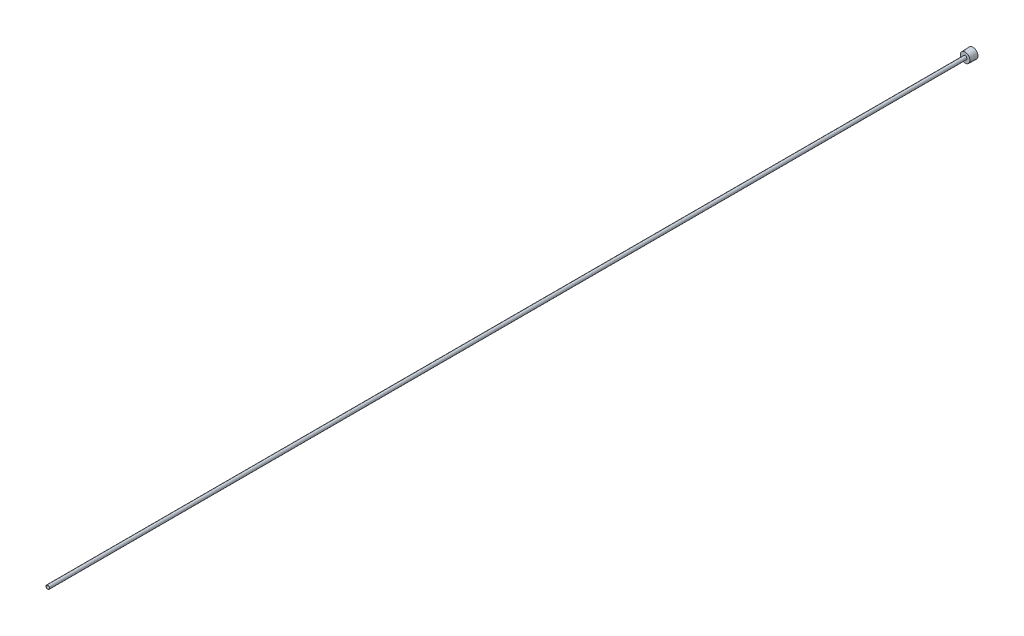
from build123d import *

# Parameters (mm, degrees)
SKETCH2_R          = 2.1209
CUT_EXTRUDE1_DEPTH = 1220.23702007
CUT_EXTRUDE2_DEPTH = 6.35


with BuildPart() as part:
    # Sketch1 → Revolve1 (revolve)
    with BuildSketch(Plane(origin=(0, 0, 0), x_dir=(0, 0, -1), z_dir=(1, 0, 0)), mode=Mode.PRIVATE) as revolve1_sk:
        Polygon((0, 0), (-1219.2, 0), (-1219.2, 2.3749), (-10.3124, 2.3749), (-10.3124, 6.342143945), (0, 6.7183), align=None)
    revolve(revolve1_sk.sketch.rotate(Axis((0, 0, 331.124179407), (0, 0, -1)), 90), axis=Axis((0, 0, 331.124179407), (0, 0, -1)))

    # Sketch2 → Cut-Extrude1 (cut, through all)
    with BuildSketch(Plane.XY.offset(1219.2)):
        Circle(SKETCH2_R)
    extrude(amount=-CUT_EXTRUDE1_DEPTH, mode=Mode.SUBTRACT)

    # Sketch3 → Cut-Extrude2 (cut)
    with BuildSketch(Plane(origin=(0, 0, 0), x_dir=(-1, 0, 0), z_dir=(0, 0, -1))):
        Polygon((-3.175, -1.833087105), (0, -3.666174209), (3.175, -1.833087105), (3.175, 1.833087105), (0, 3.666174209), (-3.175, 1.833087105), align=None)
    extrude(amount=-CUT_EXTRUDE2_DEPTH, mode=Mode.SUBTRACT)


solid = part.part
